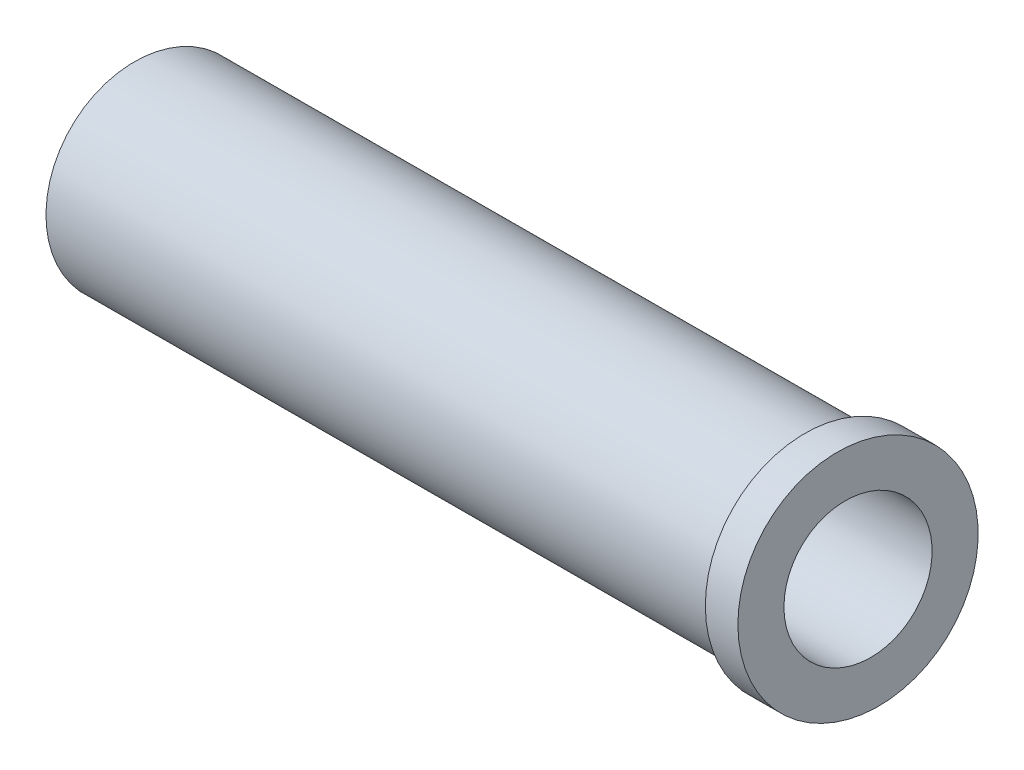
from build123d import *

# Parameters (mm, degrees)
PUNO_PROFILE_R         = 16
COLLARIN_PROFILE_R     = 18
AGUJERO_PUNO_PROFILE_R = 11.1


with BuildPart() as part:
    # Puno: sweep along a curve in space
    with BuildLine() as puno_path:
        Line((250.773980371, 39.928614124, -26.455404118), (379.480094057, 26.797990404, -39.196009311))
    # Puno profile (on start of the path) → Puno (sweep)
    with BuildSketch(Plane(origin=(250.773980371, 39.928614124, -26.455404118), x_dir=(0.10149339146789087, 0.9948362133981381, 0), z_dir=(0.9900470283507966, -0.10100479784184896, -0.09800465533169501))):
        Circle(PUNO_PROFILE_R)
    sweep(path=puno_path.line)

    # Collarin: sweep along a curve in space
    with BuildLine() as collarin_path:
        Line((250.773980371, 39.928614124, -26.455404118), (256.714262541, 39.322585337, -27.04343205))
    # Collarin profile (on start of the path) → Collarin (sweep)
    with BuildSketch(Plane(origin=(250.773980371, 39.928614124, -26.455404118), x_dir=(0.10149339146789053, 0.994836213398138, 0), z_dir=(0.9900470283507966, -0.10100479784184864, -0.09800465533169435))):
        Circle(COLLARIN_PROFILE_R)
    sweep(path=collarin_path.line)

    # Agujero_puno: sweep along a curve in space
    with BuildLine() as agujero_puno_path:
        Line((249.783933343, 40.029618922, -26.357399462), (377.5, 27, -39))
    # Agujero_puno profile (on start of the path) → Agujero_puno (sweep, cut)
    with BuildSketch(Plane(origin=(249.783933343, 40.029618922, -26.357399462), x_dir=(0.10149339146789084, 0.994836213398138, 0), z_dir=(0.9900470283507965, -0.10100479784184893, -0.09800465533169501))):
        Circle(AGUJERO_PUNO_PROFILE_R)
    sweep(path=agujero_puno_path.line, mode=Mode.SUBTRACT)


with BuildPart() as body_2:
    # Simetria_lado_izq: mirrored copy
    add(part.part.mirror(Plane(origin=(0, 0, 0), x_dir=(0, 0, 1), z_dir=(1, 0, 0))))


solid = body_2.part
